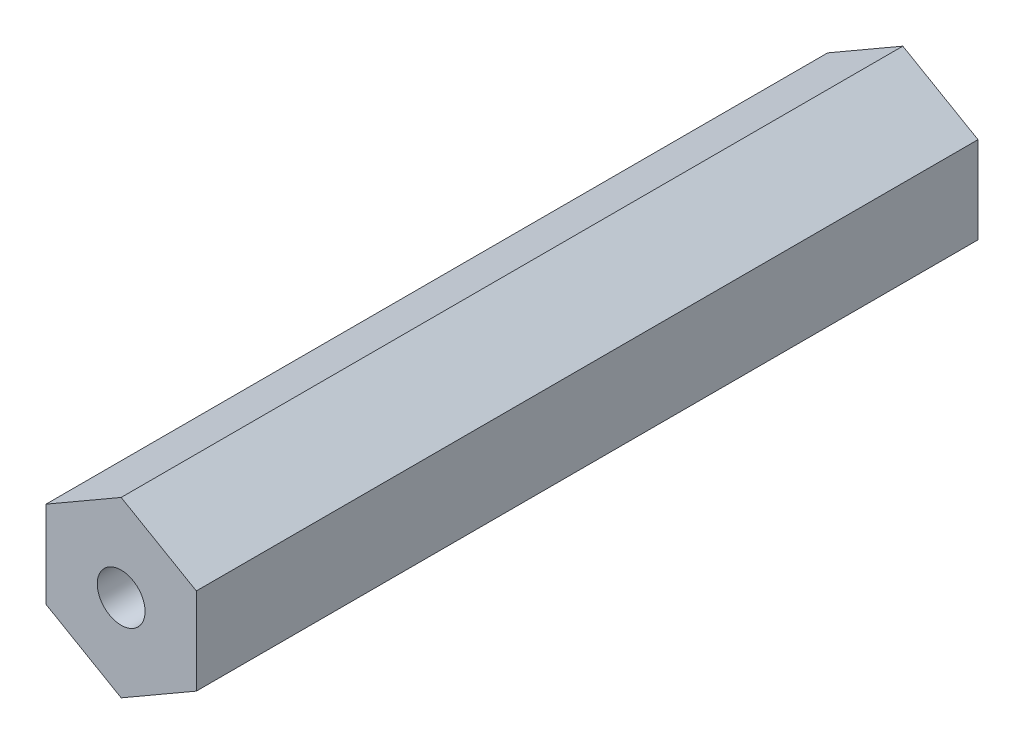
from build123d import *

# Parameters (mm, degrees)
BOSS_EXTRUDE1_DEPTH            = 66.04
TAP_DRILL_FOR_10_32_TAP1_D     = 4.0386
TAP_DRILL_FOR_10_32_TAP1_DEPTH = 12.7
TAP_DRILL_FOR_10_32_TAP1_TIP   = 1.213317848
TAP_DRILL_FOR_10_32_TAP2_D     = 4.0386
TAP_DRILL_FOR_10_32_TAP2_DEPTH = 12.7
TAP_DRILL_FOR_10_32_TAP2_TIP   = 1.213317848


with BuildPart() as part:
    # Sketch1 → Boss-Extrude1 (new body)
    with BuildSketch(Plane.XY):
        Polygon((0, 7.332348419), (-6.35, 3.666174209), (-6.35, -3.666174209), (0, -7.332348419), (6.35, -3.666174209), (6.35, 3.666174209), align=None)
    extrude(amount=BOSS_EXTRUDE1_DEPTH)

    # Tap Drill for _10-32 Tap1
    with Locations(Plane(origin=(0, 0, 0), x_dir=(-1, 0, 0), z_dir=(0, 0, -1))):
        with Locations((0, 0)):
            Hole(TAP_DRILL_FOR_10_32_TAP1_D / 2, depth=TAP_DRILL_FOR_10_32_TAP1_DEPTH)
            with Locations((0, 0, -(TAP_DRILL_FOR_10_32_TAP1_DEPTH + TAP_DRILL_FOR_10_32_TAP1_TIP / 2))):  # 118° drill point
                Cone(0, TAP_DRILL_FOR_10_32_TAP1_D / 2, TAP_DRILL_FOR_10_32_TAP1_TIP, mode=Mode.SUBTRACT)

    # Tap Drill for _10-32 Tap2
    with Locations(Plane.XY.offset(66.04)):
        with Locations((0, 0)):
            Hole(TAP_DRILL_FOR_10_32_TAP2_D / 2, depth=TAP_DRILL_FOR_10_32_TAP2_DEPTH)
            with Locations((0, 0, -(TAP_DRILL_FOR_10_32_TAP2_DEPTH + TAP_DRILL_FOR_10_32_TAP2_TIP / 2))):  # 118° drill point
                Cone(0, TAP_DRILL_FOR_10_32_TAP2_D / 2, TAP_DRILL_FOR_10_32_TAP2_TIP, mode=Mode.SUBTRACT)


solid = part.part
